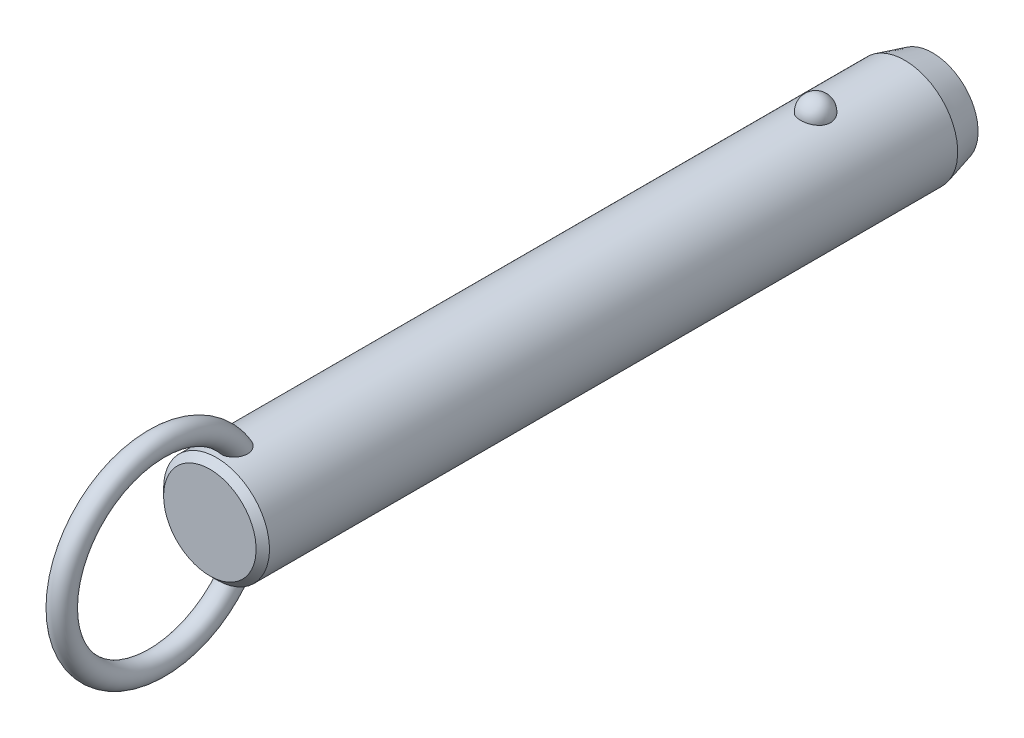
ISO-10303-21;
HEADER;
FILE_DESCRIPTION(('STEP AP214'),'2;1');
FILE_NAME('part.step','',(''),(''),'','','');
FILE_SCHEMA(('AUTOMOTIVE_DESIGN { 1 0 10303 214 1 1 1 1 }'));
ENDSEC;
DATA;
#1=APPLICATION_CONTEXT('core data for automotive mechanical design processes');
#2=APPLICATION_PROTOCOL_DEFINITION('international standard','automotive_design',2000,#1);
#3=PRODUCT_CONTEXT('',#1,'mechanical');
#4=PRODUCT('Part','Part','',(#3));
#5=PRODUCT_RELATED_PRODUCT_CATEGORY('part','',(#4));
#6=PRODUCT_DEFINITION_FORMATION('','',#4);
#7=PRODUCT_DEFINITION_CONTEXT('part definition',#1,'design');
#8=PRODUCT_DEFINITION('design','',#6,#7);
#9=PRODUCT_DEFINITION_SHAPE('','',#8);
#10=(LENGTH_UNIT() NAMED_UNIT(*) SI_UNIT(.MILLI.,.METRE.));
#11=(NAMED_UNIT(*) PLANE_ANGLE_UNIT() SI_UNIT($,.RADIAN.));
#12=(NAMED_UNIT(*) SI_UNIT($,.STERADIAN.) SOLID_ANGLE_UNIT());
#13=UNCERTAINTY_MEASURE_WITH_UNIT(LENGTH_MEASURE(1.E-05),#10,'distance_accuracy_value','');
#14=(GEOMETRIC_REPRESENTATION_CONTEXT(3) GLOBAL_UNCERTAINTY_ASSIGNED_CONTEXT((#13)) GLOBAL_UNIT_ASSIGNED_CONTEXT((#10,
#11,#12)) REPRESENTATION_CONTEXT('',''));
#15=CARTESIAN_POINT('',(0.,0.,0.));
#16=DIRECTION('',(0.,0.,1.));
#17=DIRECTION('',(1.,0.,0.));
#18=AXIS2_PLACEMENT_3D('',#15,#16,#17);
#19=CARTESIAN_POINT('',(0.,0.,96.5));
#20=DIRECTION('',(0.,0.,-1.));
#21=DIRECTION('',(-1.,0.,0.));
#22=AXIS2_PLACEMENT_3D('',#19,#20,#21);
#23=CYLINDRICAL_SURFACE('',#22,9.5);
#24=CARTESIAN_POINT('',(2.67259918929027,9.11631578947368,-2.70000000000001));
#25=CARTESIAN_POINT('',(2.6725968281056,9.11631786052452,-2.54909854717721));
#26=CARTESIAN_POINT('',(2.66030567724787,9.11994722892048,-2.39816735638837));
#27=CARTESIAN_POINT('',(2.6114347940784,9.13405924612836,-2.10058568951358));
#28=CARTESIAN_POINT('',(2.57484658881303,9.14454428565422,-1.95393672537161));
#29=CARTESIAN_POINT('',(2.47830875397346,9.17117631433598,-1.66916069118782));
#30=CARTESIAN_POINT('',(2.41836936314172,9.18732082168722,-1.53102991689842));
#31=CARTESIAN_POINT('',(2.27661331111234,9.22346780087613,-1.26705393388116));
#32=CARTESIAN_POINT('',(2.19479699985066,9.24347021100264,-1.14120852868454));
#33=CARTESIAN_POINT('',(2.01085282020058,9.28522401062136,-0.904632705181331));
#34=CARTESIAN_POINT('',(1.90862396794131,9.30698376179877,-0.793982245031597));
#35=CARTESIAN_POINT('',(1.6867437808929,9.34973971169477,-0.591607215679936));
#36=CARTESIAN_POINT('',(1.56709244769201,9.37073591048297,-0.499882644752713));
#37=CARTESIAN_POINT('',(1.31393976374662,9.40956370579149,-0.338167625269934));
#38=CARTESIAN_POINT('',(1.18048026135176,9.42740444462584,-0.268113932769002));
#39=CARTESIAN_POINT('',(0.903154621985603,9.45799906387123,-0.151390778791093));
#40=CARTESIAN_POINT('',(0.759289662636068,9.47075351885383,-0.104718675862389));
#41=CARTESIAN_POINT('',(0.468074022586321,9.48956256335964,-0.0367633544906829));
#42=CARTESIAN_POINT('',(0.320836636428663,9.49573643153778,-0.0150275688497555));
#43=CARTESIAN_POINT('',(0.0246714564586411,9.50112183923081,0.00396199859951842));
#44=CARTESIAN_POINT('',(-0.124256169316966,9.50033406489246,0.00121819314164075));
#45=CARTESIAN_POINT('',(-0.417264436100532,9.4919475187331,-0.0284441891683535));
#46=CARTESIAN_POINT('',(-0.56138413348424,9.48444885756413,-0.0550074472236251));
#47=CARTESIAN_POINT('',(-0.842986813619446,9.46357853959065,-0.131064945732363));
#48=CARTESIAN_POINT('',(-0.980469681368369,9.450206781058,-0.180559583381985));
#49=CARTESIAN_POINT('',(-1.24585005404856,9.41890822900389,-0.301476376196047));
#50=CARTESIAN_POINT('',(-1.37368611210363,9.40095498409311,-0.373026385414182));
#51=CARTESIAN_POINT('',(-1.61552738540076,9.36242964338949,-0.536025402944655));
#52=CARTESIAN_POINT('',(-1.72953116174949,9.34185727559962,-0.627476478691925));
#53=CARTESIAN_POINT('',(-1.9429225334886,9.29984568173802,-0.829844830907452));
#54=CARTESIAN_POINT('',(-2.04198021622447,9.27839736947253,-0.94110821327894));
#55=CARTESIAN_POINT('',(-2.22026460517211,9.23735994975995,-1.17883414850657));
#56=CARTESIAN_POINT('',(-2.29948985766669,9.21777097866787,-1.30529781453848));
#57=CARTESIAN_POINT('',(-2.43697287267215,9.18238994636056,-1.57158566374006));
#58=CARTESIAN_POINT('',(-2.49497068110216,9.16664569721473,-1.71155057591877));
#59=CARTESIAN_POINT('',(-2.5872073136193,9.14104303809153,-1.99961197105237));
#60=CARTESIAN_POINT('',(-2.62144683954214,9.13118445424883,-2.14770821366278));
#61=CARTESIAN_POINT('',(-2.66521466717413,9.11850622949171,-2.44715424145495));
#62=CARTESIAN_POINT('',(-2.67484831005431,9.11565658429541,-2.59848735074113));
#63=CARTESIAN_POINT('',(-2.66946735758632,9.11723375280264,-2.90067317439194));
#64=CARTESIAN_POINT('',(-2.65445345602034,9.12166036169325,-3.05152590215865));
#65=CARTESIAN_POINT('',(-2.60029711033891,9.13724422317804,-3.34766110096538));
#66=CARTESIAN_POINT('',(-2.56127978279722,9.14836656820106,-3.49296833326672));
#67=CARTESIAN_POINT('',(-2.46018844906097,9.17606676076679,-3.77477535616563));
#68=CARTESIAN_POINT('',(-2.39811349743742,9.1926448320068,-3.9112747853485));
#69=CARTESIAN_POINT('',(-2.25202303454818,9.22952198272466,-4.17244273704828));
#70=CARTESIAN_POINT('',(-2.16788714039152,9.24984129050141,-4.29704106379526));
#71=CARTESIAN_POINT('',(-1.9799408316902,9.29188255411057,-4.53013066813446));
#72=CARTESIAN_POINT('',(-1.87612963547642,9.31360456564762,-4.63862130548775));
#73=CARTESIAN_POINT('',(-1.65105429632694,9.35612959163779,-4.8369029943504));
#74=CARTESIAN_POINT('',(-1.52972405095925,9.37692871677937,-4.92661991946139));
#75=CARTESIAN_POINT('',(-1.27318250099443,9.41518970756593,-5.08429106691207));
#76=CARTESIAN_POINT('',(-1.13797219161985,9.432651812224,-5.15224684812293));
#77=CARTESIAN_POINT('',(-0.859280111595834,9.46208255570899,-5.26371827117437));
#78=CARTESIAN_POINT('',(-0.715925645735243,9.47411833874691,-5.30753421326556));
#79=CARTESIAN_POINT('',(-0.423550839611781,9.4916822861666,-5.37076321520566));
#80=CARTESIAN_POINT('',(-0.2745312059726,9.49721125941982,-5.39017930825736));
#81=CARTESIAN_POINT('',(0.0218446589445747,9.50110860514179,-5.40390587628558));
#82=CARTESIAN_POINT('',(0.16917707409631,9.49961381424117,-5.39869609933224));
#83=CARTESIAN_POINT('',(0.460808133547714,9.48993906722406,-5.36441955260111));
#84=CARTESIAN_POINT('',(0.605106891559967,9.48175936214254,-5.33535367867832));
#85=CARTESIAN_POINT('',(0.886027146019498,9.4596376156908,-5.25435587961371));
#86=CARTESIAN_POINT('',(1.02267710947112,9.44571881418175,-5.20251612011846));
#87=CARTESIAN_POINT('',(1.28523827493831,9.41358993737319,-5.07741549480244));
#88=CARTESIAN_POINT('',(1.41114877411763,9.39537958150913,-5.00415322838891));
#89=CARTESIAN_POINT('',(1.65085227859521,9.3562644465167,-4.83684599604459));
#90=CARTESIAN_POINT('',(1.76442346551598,9.33532178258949,-4.74249218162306));
#91=CARTESIAN_POINT('',(1.97425672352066,9.29321198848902,-4.53620389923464));
#92=CARTESIAN_POINT('',(2.07051582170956,9.27204482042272,-4.42426641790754));
#93=CARTESIAN_POINT('',(2.24490086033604,9.23139221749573,-4.18363183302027));
#94=CARTESIAN_POINT('',(2.32267019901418,9.21194380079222,-4.05466990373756));
#95=CARTESIAN_POINT('',(2.45584092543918,9.1773419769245,-3.78517836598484));
#96=CARTESIAN_POINT('',(2.5112497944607,9.16218713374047,-3.64465264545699));
#97=CARTESIAN_POINT('',(2.59380876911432,9.13913522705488,-3.37104301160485));
#98=CARTESIAN_POINT('',(2.62330266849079,9.13064624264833,-3.23871053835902));
#99=CARTESIAN_POINT('',(2.66269870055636,9.11923566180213,-2.97092664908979));
#100=CARTESIAN_POINT('',(2.67260130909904,9.11631393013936,-2.83547530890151));
#101=CARTESIAN_POINT('',(2.67259918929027,9.11631578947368,-2.70000000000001));
#102=B_SPLINE_CURVE_WITH_KNOTS('',3,(#24,#25,#26,#27,#28,#29,#30,#31,#32,#33,#34,#35,#36,#37,
#38,#39,#40,#41,#42,#43,#44,#45,#46,#47,#48,#49,#50,#51,#52,#53,#54,#55,#56,#57,#58,#59,#60,#61,
#62,#63,#64,#65,#66,#67,#68,#69,#70,#71,#72,#73,#74,#75,#76,#77,#78,#79,#80,#81,#82,#83,#84,#85,
#86,#87,#88,#89,#90,#91,#92,#93,#94,#95,#96,#97,#98,#99,#100,#101),.UNSPECIFIED.,.T.,.F.,(4,2,2,
2,2,2,2,2,2,2,2,2,2,2,2,2,2,2,2,2,2,2,2,2,2,2,2,2,2,2,2,2,2,2,2,2,2,2,4),(0.,0.452217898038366,
0.904593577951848,1.35677112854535,1.80894144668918,2.26340676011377,2.71787203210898,
3.17099820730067,3.62407318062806,4.0687883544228,4.51345969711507,4.95160616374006,
5.38976021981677,5.83050358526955,6.27129275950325,6.72071308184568,7.17016633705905,
7.62495278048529,8.07972578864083,8.53254856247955,8.98535859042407,9.43582813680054,
9.88631615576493,10.3393155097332,10.7923328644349,11.2471065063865,11.7018475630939,
12.150795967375,12.599688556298,13.0398725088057,13.4800399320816,13.9184421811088,
14.3568730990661,14.802202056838,15.2476074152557,15.7010097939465,16.1542603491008,
16.5602594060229,16.966248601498),.UNSPECIFIED.);
#103=CARTESIAN_POINT('',(2.67259918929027,9.11631578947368,-2.70000000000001));
#104=VERTEX_POINT('',#103);
#105=EDGE_CURVE('E41',#104,#104,#102,.T.);
#106=ORIENTED_EDGE('',*,*,#105,.T.);
#107=EDGE_LOOP('',(#106));
#108=FACE_BOUND('',#107,.T.);
#109=CARTESIAN_POINT('',(0.,0.,104.82));
#110=DIRECTION('',(0.,0.,1.));
#111=DIRECTION('',(1.,0.,0.));
#112=AXIS2_PLACEMENT_3D('',#109,#110,#111);
#113=CIRCLE('',#112,9.5);
#114=CARTESIAN_POINT('',(-9.50000000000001,0.,104.82));
#115=VERTEX_POINT('',#114);
#116=EDGE_CURVE('E10',#115,#115,#113,.F.);
#117=ORIENTED_EDGE('',*,*,#116,.T.);
#118=EDGE_LOOP('',(#117));
#119=FACE_BOUND('',#118,.T.);
#120=CARTESIAN_POINT('',(-0.697062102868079,-9.47439269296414,99.1678088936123));
#121=CARTESIAN_POINT('',(-0.799579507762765,-9.46685146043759,99.2074823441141));
#122=CARTESIAN_POINT('',(-0.898575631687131,-9.45788043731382,99.2559309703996));
#123=CARTESIAN_POINT('',(-1.08670047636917,-9.43811593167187,99.3688685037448));
#124=CARTESIAN_POINT('',(-1.17583204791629,-9.42732297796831,99.4333527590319));
#125=CARTESIAN_POINT('',(-1.34179806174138,-9.40513672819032,99.5762099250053));
#126=CARTESIAN_POINT('',(-1.41865133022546,-9.39374438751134,99.654561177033));
#127=CARTESIAN_POINT('',(-1.5586004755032,-9.37154196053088,99.8227524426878));
#128=CARTESIAN_POINT('',(-1.62169476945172,-9.3607319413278,99.9125937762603));
#129=CARTESIAN_POINT('',(-1.73527695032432,-9.34035749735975,100.104500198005));
#130=CARTESIAN_POINT('',(-1.7852226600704,-9.33085270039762,100.206891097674));
#131=CARTESIAN_POINT('',(-1.86924997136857,-9.3143834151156,100.418148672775));
#132=CARTESIAN_POINT('',(-1.90332570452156,-9.30741986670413,100.527017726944));
#133=CARTESIAN_POINT('',(-1.95893603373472,-9.29588482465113,100.760473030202));
#134=CARTESIAN_POINT('',(-1.97872420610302,-9.29165182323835,100.885489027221));
#135=CARTESIAN_POINT('',(-2.00062129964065,-9.28695978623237,101.137080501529));
#136=CARTESIAN_POINT('',(-2.00272284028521,-9.28650232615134,101.263656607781));
#137=CARTESIAN_POINT('',(-1.98958876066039,-9.28932750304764,101.536815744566));
#138=CARTESIAN_POINT('',(-1.97143366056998,-9.2932400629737,101.683251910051));
#139=CARTESIAN_POINT('',(-1.91479925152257,-9.30507151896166,101.972062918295));
#140=CARTESIAN_POINT('',(-1.87629122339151,-9.31299607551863,102.114431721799));
#141=CARTESIAN_POINT('',(-1.77225683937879,-9.33340232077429,102.415172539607));
#142=CARTESIAN_POINT('',(-1.70334898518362,-9.34641636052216,102.572369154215));
#143=CARTESIAN_POINT('',(-1.58111062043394,-9.36759153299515,102.797517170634));
#144=CARTESIAN_POINT('',(-1.53721459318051,-9.37492619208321,102.870796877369));
#145=CARTESIAN_POINT('',(-1.44302631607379,-9.38988566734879,103.01307405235));
#146=CARTESIAN_POINT('',(-1.39273721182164,-9.39751033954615,103.082073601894));
#147=CARTESIAN_POINT('',(-1.26775962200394,-9.41530678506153,103.236983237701));
#148=CARTESIAN_POINT('',(-1.19052326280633,-9.42548108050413,103.320871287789));
#149=CARTESIAN_POINT('',(-1.02420241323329,-9.44499825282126,103.476008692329));
#150=CARTESIAN_POINT('',(-0.935139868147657,-9.45434261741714,103.547280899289));
#151=CARTESIAN_POINT('',(-0.766610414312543,-9.46930670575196,103.658695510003));
#152=CARTESIAN_POINT('',(-0.689439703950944,-9.47529223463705,103.702235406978));
#153=CARTESIAN_POINT('',(-0.528942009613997,-9.48560294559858,103.77631336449));
#154=CARTESIAN_POINT('',(-0.445620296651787,-9.48992953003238,103.806862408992));
#155=CARTESIAN_POINT('',(-0.273901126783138,-9.49644161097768,103.852579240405));
#156=CARTESIAN_POINT('',(-0.185465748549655,-9.49860811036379,103.86761059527));
#157=CARTESIAN_POINT('',(-0.00734541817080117,-9.5004135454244,103.880149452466));
#158=CARTESIAN_POINT('',(0.0823387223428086,-9.50005405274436,103.877667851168));
#159=CARTESIAN_POINT('',(0.247679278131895,-9.49708301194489,103.856995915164));
#160=CARTESIAN_POINT('',(0.323620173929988,-9.49477609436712,103.840930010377));
#161=CARTESIAN_POINT('',(0.471981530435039,-9.48855917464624,103.797172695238));
#162=CARTESIAN_POINT('',(0.544400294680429,-9.48464840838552,103.769475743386));
#163=CARTESIAN_POINT('',(0.70894789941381,-9.47398336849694,103.69280266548));
#164=CARTESIAN_POINT('',(0.799149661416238,-9.46671310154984,103.639774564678));
#165=CARTESIAN_POINT('',(0.969783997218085,-9.45076225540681,103.519973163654));
#166=CARTESIAN_POINT('',(1.05019415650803,-9.44207854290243,103.453169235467));
#167=CARTESIAN_POINT('',(1.23092343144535,-9.42051459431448,103.280759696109));
#168=CARTESIAN_POINT('',(1.3265249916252,-9.40733378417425,103.17026193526));
#169=CARTESIAN_POINT('',(1.49893121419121,-9.38140745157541,102.935561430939));
#170=CARTESIAN_POINT('',(1.57571616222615,-9.36866239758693,102.811344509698));
#171=CARTESIAN_POINT('',(1.71285426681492,-9.34457644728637,102.549389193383));
#172=CARTESIAN_POINT('',(1.77266365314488,-9.33328726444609,102.41136233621));
#173=CARTESIAN_POINT('',(1.87239208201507,-9.31379209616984,102.128051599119));
#174=CARTESIAN_POINT('',(1.9123015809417,-9.3055875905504,101.982764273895));
#175=CARTESIAN_POINT('',(1.97604189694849,-9.29228394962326,101.662028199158));
#176=CARTESIAN_POINT('',(1.99587438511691,-9.28797202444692,101.485724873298));
#177=CARTESIAN_POINT('',(2.0029570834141,-9.28645519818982,101.132414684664));
#178=CARTESIAN_POINT('',(1.99025930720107,-9.28923895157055,100.955409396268));
#179=CARTESIAN_POINT('',(1.93735479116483,-9.30038134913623,100.656338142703));
#180=CARTESIAN_POINT('',(1.90576827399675,-9.30697680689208,100.532667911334));
#181=CARTESIAN_POINT('',(1.82287484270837,-9.32356855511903,100.292329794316));
#182=CARTESIAN_POINT('',(1.77158213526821,-9.33356239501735,100.175656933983));
#183=CARTESIAN_POINT('',(1.64885744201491,-9.35602275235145,99.9527061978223));
#184=CARTESIAN_POINT('',(1.57730995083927,-9.36850332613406,99.8464927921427));
#185=CARTESIAN_POINT('',(1.4154326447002,-9.39431873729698,99.6495530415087));
#186=CARTESIAN_POINT('',(1.32510883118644,-9.40765330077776,99.5588217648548));
#187=CARTESIAN_POINT('',(1.13846223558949,-9.43195720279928,99.4050334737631));
#188=CARTESIAN_POINT('',(1.04369890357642,-9.44302894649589,99.3400947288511));
#189=CARTESIAN_POINT('',(0.843965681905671,-9.46296805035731,99.2280388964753));
#190=CARTESIAN_POINT('',(0.739000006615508,-9.47183631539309,99.1809144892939));
#191=CARTESIAN_POINT('',(0.528175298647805,-9.48586140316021,99.1081173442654));
#192=CARTESIAN_POINT('',(0.422686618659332,-9.49119633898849,99.0814024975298));
#193=CARTESIAN_POINT('',(0.208590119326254,-9.49831365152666,99.0460137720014));
#194=CARTESIAN_POINT('',(0.0999817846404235,-9.500095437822,99.0373428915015));
#195=CARTESIAN_POINT('',(-0.126104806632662,-9.49988861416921,99.0383501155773));
#196=CARTESIAN_POINT('',(-0.24357872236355,-9.49757821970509,99.0495942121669));
#197=CARTESIAN_POINT('',(-0.474390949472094,-9.48885165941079,99.093167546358));
#198=CARTESIAN_POINT('',(-0.587729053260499,-9.48243528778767,99.1254978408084));
#199=CARTESIAN_POINT('',(-0.697062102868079,-9.47439269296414,99.1678088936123));
#200=B_SPLINE_CURVE_WITH_KNOTS('',3,(#120,#121,#122,#123,#124,#125,#126,#127,#128,#129,#130,
#131,#132,#133,#134,#135,#136,#137,#138,#139,#140,#141,#142,#143,#144,#145,#146,#147,#148,#149,
#150,#151,#152,#153,#154,#155,#156,#157,#158,#159,#160,#161,#162,#163,#164,#165,#166,#167,#168,
#169,#170,#171,#172,#173,#174,#175,#176,#177,#178,#179,#180,#181,#182,#183,#184,#185,#186,#187,
#188,#189,#190,#191,#192,#193,#194,#195,#196,#197,#198,#199),.UNSPECIFIED.,.T.,.F.,(4,2,2,2,2,2,
2,2,2,2,2,2,2,2,2,2,2,2,2,2,2,2,2,2,2,2,2,2,2,2,2,2,2,2,2,2,2,2,2,4),(0.,0.330119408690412,
0.660143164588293,0.989655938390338,1.31920659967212,1.66074728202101,2.00241415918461,
2.38088696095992,2.7595176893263,3.20065679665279,3.6424200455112,4.15620996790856,
4.41314162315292,4.66994734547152,5.01228664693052,5.35399933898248,5.61943037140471,
5.88463652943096,6.15215502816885,6.41950709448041,6.65144391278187,6.88349136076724,
7.19641200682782,7.51003602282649,7.94779711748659,8.38601491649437,8.83699707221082,
9.28819530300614,9.81778662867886,10.3465317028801,10.7284172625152,11.110028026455,
11.4938603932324,11.8775702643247,12.2220189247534,12.5663259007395,12.8915939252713,
13.2169159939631,13.5689650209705,13.9210316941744),.UNSPECIFIED.);
#201=CARTESIAN_POINT('',(-0.697062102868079,-9.47439269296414,99.1678088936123));
#202=VERTEX_POINT('',#201);
#203=EDGE_CURVE('E60',#202,#202,#200,.T.);
#204=ORIENTED_EDGE('',*,*,#203,.T.);
#205=EDGE_LOOP('',(#204));
#206=FACE_BOUND('',#205,.T.);
#207=CARTESIAN_POINT('',(-0.697062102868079,9.47439269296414,99.1678088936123));
#208=CARTESIAN_POINT('',(-0.59779262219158,9.48169483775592,99.1293956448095));
#209=CARTESIAN_POINT('',(-0.495106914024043,9.48766580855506,99.0991682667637));
#210=CARTESIAN_POINT('',(-0.285876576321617,9.49627648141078,99.0560327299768));
#211=CARTESIAN_POINT('',(-0.179324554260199,9.49890941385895,99.0431597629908));
#212=CARTESIAN_POINT('',(0.0344157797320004,9.50053798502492,99.0351666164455));
#213=CARTESIAN_POINT('',(0.141603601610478,9.49953613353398,99.0400341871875));
#214=CARTESIAN_POINT('',(0.353563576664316,9.49401038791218,99.0673654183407));
#215=CARTESIAN_POINT('',(0.458336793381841,9.48948807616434,99.08982117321));
#216=CARTESIAN_POINT('',(0.66249373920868,9.4774236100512,99.1516719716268));
#217=CARTESIAN_POINT('',(0.761881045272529,9.46988348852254,99.1910556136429));
#218=CARTESIAN_POINT('',(0.952608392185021,9.45260382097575,99.2856342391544));
#219=CARTESIAN_POINT('',(1.04394806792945,9.44286417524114,99.3408299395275));
#220=CARTESIAN_POINT('',(1.21712767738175,9.42211760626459,99.4660662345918));
#221=CARTESIAN_POINT('',(1.29885671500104,9.41109835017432,99.5362579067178));
#222=CARTESIAN_POINT('',(1.44978975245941,9.38903310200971,99.688980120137));
#223=CARTESIAN_POINT('',(1.51899278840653,9.37798710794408,99.7715116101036));
#224=CARTESIAN_POINT('',(1.64602857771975,9.35654375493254,99.9497763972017));
#225=CARTESIAN_POINT('',(1.70333052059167,9.34618688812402,100.045891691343));
#226=CARTESIAN_POINT('',(1.80259341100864,9.32755128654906,100.245897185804));
#227=CARTESIAN_POINT('',(1.84454942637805,9.31927322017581,100.349789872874));
#228=CARTESIAN_POINT('',(1.91637039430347,9.30478365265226,100.572213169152));
#229=CARTESIAN_POINT('',(1.944805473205,9.29882552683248,100.691219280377));
#230=CARTESIAN_POINT('',(1.98449865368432,9.29043398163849,100.932143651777));
#231=CARTESIAN_POINT('',(1.99574908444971,9.28800213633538,101.054063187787));
#232=CARTESIAN_POINT('',(2.00275141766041,9.28649645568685,101.316932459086));
#233=CARTESIAN_POINT('',(1.99588238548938,9.28799035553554,101.457952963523));
#234=CARTESIAN_POINT('',(1.96270559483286,9.29505517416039,101.737621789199));
#235=CARTESIAN_POINT('',(1.93637872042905,9.30063010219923,101.876267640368));
#236=CARTESIAN_POINT('',(1.85949176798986,9.31633564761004,102.172561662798));
#237=CARTESIAN_POINT('',(1.80549792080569,9.3270926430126,102.329290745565));
#238=CARTESIAN_POINT('',(1.67376869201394,9.3516306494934,102.632284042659));
#239=CARTESIAN_POINT('',(1.59603181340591,9.36541185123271,102.778547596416));
#240=CARTESIAN_POINT('',(1.4360277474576,9.39110706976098,103.025813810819));
#241=CARTESIAN_POINT('',(1.35831795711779,9.40278656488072,103.129791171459));
#242=CARTESIAN_POINT('',(1.18774483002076,9.42585025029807,103.324534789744));
#243=CARTESIAN_POINT('',(1.09490932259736,9.43723493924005,103.415324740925));
#244=CARTESIAN_POINT('',(0.921110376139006,9.45552616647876,103.55620334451));
#245=CARTESIAN_POINT('',(0.843738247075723,9.46281058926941,103.610656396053));
#246=CARTESIAN_POINT('',(0.681245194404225,9.47589120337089,103.706711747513));
#247=CARTESIAN_POINT('',(0.596135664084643,9.48168953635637,103.748332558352));
#248=CARTESIAN_POINT('',(0.433779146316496,9.49038144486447,103.810089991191));
#249=CARTESIAN_POINT('',(0.357459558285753,9.49359170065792,103.83260136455));
#250=CARTESIAN_POINT('',(0.202074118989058,9.49816761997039,103.864574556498));
#251=CARTESIAN_POINT('',(0.123010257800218,9.49953459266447,103.874045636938));
#252=CARTESIAN_POINT('',(-0.0357372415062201,9.50026497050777,103.879114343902));
#253=CARTESIAN_POINT('',(-0.115421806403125,9.49962433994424,103.874684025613));
#254=CARTESIAN_POINT('',(-0.272823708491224,9.49640854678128,103.852296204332));
#255=CARTESIAN_POINT('',(-0.350540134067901,9.4938325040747,103.834332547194));
#256=CARTESIAN_POINT('',(-0.500580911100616,9.4870946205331,103.786802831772));
#257=CARTESIAN_POINT('',(-0.57297929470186,9.48296359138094,103.757461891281));
#258=CARTESIAN_POINT('',(-0.712864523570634,9.47347609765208,103.689008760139));
#259=CARTESIAN_POINT('',(-0.780349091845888,9.46811906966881,103.649892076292));
#260=CARTESIAN_POINT('',(-0.946309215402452,9.45329720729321,103.539432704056));
#261=CARTESIAN_POINT('',(-1.04090230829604,9.44321512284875,103.462329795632));
#262=CARTESIAN_POINT('',(-1.21661929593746,9.42219227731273,103.29409718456));
#263=CARTESIAN_POINT('',(-1.29770519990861,9.41124921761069,103.202929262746));
#264=CARTESIAN_POINT('',(-1.47319646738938,9.38563439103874,102.976162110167));
#265=CARTESIAN_POINT('',(-1.5620887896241,9.37102009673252,102.836289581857));
#266=CARTESIAN_POINT('',(-1.71623987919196,9.34401559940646,102.543950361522));
#267=CARTESIAN_POINT('',(-1.78147866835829,9.33162728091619,102.391473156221));
#268=CARTESIAN_POINT('',(-1.88853837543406,9.31055541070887,102.075647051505));
#269=CARTESIAN_POINT('',(-1.92998995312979,9.30193076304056,101.912168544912));
#270=CARTESIAN_POINT('',(-1.98590726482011,9.29015757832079,101.580526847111));
#271=CARTESIAN_POINT('',(-2.0004070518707,9.2870021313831,101.412369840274));
#272=CARTESIAN_POINT('',(-1.99964701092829,9.28716218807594,101.105080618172));
#273=CARTESIAN_POINT('',(-1.98908145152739,9.28945704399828,100.965936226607));
#274=CARTESIAN_POINT('',(-1.94566294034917,9.29865169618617,100.691153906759));
#275=CARTESIAN_POINT('',(-1.91282062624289,9.30554929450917,100.555514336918));
#276=CARTESIAN_POINT('',(-1.84582133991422,9.31898248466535,100.357802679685));
#277=CARTESIAN_POINT('',(-1.82038084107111,9.32400364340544,100.292583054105));
#278=CARTESIAN_POINT('',(-1.7635051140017,9.33492884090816,100.164903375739));
#279=CARTESIAN_POINT('',(-1.73207305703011,9.34083241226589,100.102441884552));
#280=CARTESIAN_POINT('',(-1.6632424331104,9.353333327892,99.9809407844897));
#281=CARTESIAN_POINT('',(-1.62584239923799,9.35993084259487,99.9219020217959));
#282=CARTESIAN_POINT('',(-1.54527678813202,9.37356864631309,99.8079875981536));
#283=CARTESIAN_POINT('',(-1.50211241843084,9.38060884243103,99.7531110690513));
#284=CARTESIAN_POINT('',(-1.37681147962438,9.40004442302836,99.6099619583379));
#285=CARTESIAN_POINT('',(-1.28916358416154,9.41261047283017,99.5264295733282));
#286=CARTESIAN_POINT('',(-1.09996826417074,9.43658180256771,99.3772360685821));
#287=CARTESIAN_POINT('',(-0.998461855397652,9.44799034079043,99.3115238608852));
#288=CARTESIAN_POINT('',(-0.860188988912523,9.46103017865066,99.2394367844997));
#289=CARTESIAN_POINT('',(-0.828141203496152,9.46389141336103,99.2238511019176));
#290=CARTESIAN_POINT('',(-0.763210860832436,9.46934915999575,99.1944734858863));
#291=CARTESIAN_POINT('',(-0.730328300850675,9.47194567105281,99.1806815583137));
#292=CARTESIAN_POINT('',(-0.697062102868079,9.47439269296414,99.1678088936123));
#293=B_SPLINE_CURVE_WITH_KNOTS('',3,(#207,#208,#209,#210,#211,#212,#213,#214,#215,#216,#217,
#218,#219,#220,#221,#222,#223,#224,#225,#226,#227,#228,#229,#230,#231,#232,#233,#234,#235,#236,
#237,#238,#239,#240,#241,#242,#243,#244,#245,#246,#247,#248,#249,#250,#251,#252,#253,#254,#255,
#256,#257,#258,#259,#260,#261,#262,#263,#264,#265,#266,#267,#268,#269,#270,#271,#272,#273,#274,
#275,#276,#277,#278,#279,#280,#281,#282,#283,#284,#285,#286,#287,#288,#289,#290,#291,#292),
.UNSPECIFIED.,.T.,.F.,(4,2,2,2,2,2,2,2,2,2,2,2,2,2,2,2,2,2,2,2,2,2,2,2,2,2,2,2,2,2,2,2,2,2,2,2,
2,2,2,2,2,2,4),(0.,0.319942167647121,0.640532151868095,0.960900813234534,1.28112555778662,
1.60113495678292,1.92115886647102,2.24457323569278,2.56801248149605,2.90371927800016,
3.23953387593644,3.60560313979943,3.97183576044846,4.39383693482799,4.81625324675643,
5.31257045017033,5.80891895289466,6.19868344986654,6.58773876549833,6.87145417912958,
7.15475838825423,7.3926375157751,7.63034760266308,7.86853584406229,8.10683246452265,
8.3406366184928,8.57454843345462,8.93983939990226,9.30614105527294,9.80266668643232,
10.2996107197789,10.8040753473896,11.3079021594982,11.7249776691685,12.1418541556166,
12.3521485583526,12.562331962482,12.7725671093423,12.9827582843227,13.345827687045,
13.7078449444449,13.8150604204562,13.9222762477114),.UNSPECIFIED.);
#294=CARTESIAN_POINT('',(-0.697062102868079,9.47439269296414,99.1678088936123));
#295=VERTEX_POINT('',#294);
#296=EDGE_CURVE('E68',#295,#295,#293,.T.);
#297=ORIENTED_EDGE('',*,*,#296,.T.);
#298=EDGE_LOOP('',(#297));
#299=FACE_BOUND('',#298,.T.);
#300=CARTESIAN_POINT('',(0.,0.,-18.6999999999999));
#301=DIRECTION('',(0.,0.,-1.));
#302=DIRECTION('',(-1.,0.,0.));
#303=AXIS2_PLACEMENT_3D('',#300,#301,#302);
#304=CIRCLE('',#303,9.5);
#305=CARTESIAN_POINT('',(-9.5,0.,-18.6999999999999));
#306=VERTEX_POINT('',#305);
#307=EDGE_CURVE('E57',#306,#306,#304,.F.);
#308=ORIENTED_EDGE('',*,*,#307,.T.);
#309=EDGE_LOOP('',(#308));
#310=FACE_BOUND('',#309,.T.);
#311=ADVANCED_FACE('F37',(#108,#119,#206,#299,#310),#23,.T.);
#312=CARTESIAN_POINT('',(0.,0.,-23.7));
#313=DIRECTION('',(0.,0.,-1.));
#314=DIRECTION('',(-1.,0.,0.));
#315=AXIS2_PLACEMENT_3D('',#312,#313,#314);
#316=PLANE('',#315);
#317=CARTESIAN_POINT('',(0.,0.,-23.7));
#318=DIRECTION('',(0.,0.,-1.));
#319=DIRECTION('',(-1.,0.,0.));
#320=AXIS2_PLACEMENT_3D('',#317,#318,#319);
#321=CIRCLE('',#320,8.16025403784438);
#322=CARTESIAN_POINT('',(-8.16025403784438,0.,-23.7));
#323=VERTEX_POINT('',#322);
#324=EDGE_CURVE('E67',#323,#323,#321,.T.);
#325=ORIENTED_EDGE('',*,*,#324,.T.);
#326=EDGE_LOOP('',(#325));
#327=FACE_BOUND('',#326,.T.);
#328=ADVANCED_FACE('F86',(#327),#316,.T.);
#329=CARTESIAN_POINT('',(0.,0.,-23.7));
#330=DIRECTION('',(0.,0.,1.));
#331=DIRECTION('',(1.,0.,0.));
#332=AXIS2_PLACEMENT_3D('',#329,#330,#331);
#333=CONICAL_SURFACE('',#332,8.16025403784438,0.261799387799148);
#334=ORIENTED_EDGE('',*,*,#307,.F.);
#335=EDGE_LOOP('',(#334));
#336=FACE_BOUND('',#335,.T.);
#337=ORIENTED_EDGE('',*,*,#324,.F.);
#338=EDGE_LOOP('',(#337));
#339=FACE_BOUND('',#338,.T.);
#340=ADVANCED_FACE('F84',(#336,#339),#333,.T.);
#341=CARTESIAN_POINT('',(0.,0.,106.02));
#342=DIRECTION('',(0.,0.,1.));
#343=DIRECTION('',(1.,0.,0.));
#344=AXIS2_PLACEMENT_3D('',#341,#342,#343);
#345=PLANE('',#344);
#346=CARTESIAN_POINT('',(0.,0.,106.02));
#347=DIRECTION('',(0.,0.,1.));
#348=DIRECTION('',(1.,0.,0.));
#349=AXIS2_PLACEMENT_3D('',#346,#347,#348);
#350=CIRCLE('',#349,8.29999999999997);
#351=CARTESIAN_POINT('',(-8.29999999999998,0.,106.02));
#352=VERTEX_POINT('',#351);
#353=EDGE_CURVE('E50',#352,#352,#350,.T.);
#354=ORIENTED_EDGE('',*,*,#353,.T.);
#355=EDGE_LOOP('',(#354));
#356=FACE_BOUND('',#355,.T.);
#357=ADVANCED_FACE('F78',(#356),#345,.T.);
#358=CARTESIAN_POINT('',(0.,0.,115.55));
#359=DIRECTION('',(1.,0.,0.));
#360=DIRECTION('',(0.,0.,-1.));
#361=AXIS2_PLACEMENT_3D('',#358,#359,#360);
#362=TOROIDAL_SURFACE('',#361,17.05,2.);
#363=ORIENTED_EDGE('',*,*,#296,.F.);
#364=EDGE_LOOP('',(#363));
#365=FACE_BOUND('',#364,.T.);
#366=ORIENTED_EDGE('',*,*,#203,.F.);
#367=EDGE_LOOP('',(#366));
#368=FACE_BOUND('',#367,.T.);
#369=ADVANCED_FACE('F74',(#365,#368),#362,.T.);
#370=CARTESIAN_POINT('',(0.,0.,106.02));
#371=DIRECTION('',(0.,0.,-1.));
#372=DIRECTION('',(-1.,0.,0.));
#373=AXIS2_PLACEMENT_3D('',#370,#371,#372);
#374=CONICAL_SURFACE('',#373,8.29999999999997,0.78539816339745);
#375=CARTESIAN_POINT('',(-9.50000000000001,0.,104.82));
#376=CARTESIAN_POINT('',(-9.48750000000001,0.,104.8325));
#377=CARTESIAN_POINT('',(-9.47500000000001,0.,104.845));
#378=CARTESIAN_POINT('',(-9.45,0.,104.87));
#379=CARTESIAN_POINT('',(-9.4375,0.,104.8825));
#380=CARTESIAN_POINT('',(-9.4125,0.,104.9075));
#381=CARTESIAN_POINT('',(-9.4,0.,104.92));
#382=CARTESIAN_POINT('',(-9.37500000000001,0.,104.945));
#383=CARTESIAN_POINT('',(-9.3625,0.,104.9575));
#384=CARTESIAN_POINT('',(-9.3375,0.,104.9825));
#385=CARTESIAN_POINT('',(-9.325,0.,104.995));
#386=CARTESIAN_POINT('',(-9.3,0.,105.02));
#387=CARTESIAN_POINT('',(-9.2875,0.,105.0325));
#388=CARTESIAN_POINT('',(-9.2625,0.,105.0575));
#389=CARTESIAN_POINT('',(-9.25,0.,105.07));
#390=CARTESIAN_POINT('',(-9.225,0.,105.095));
#391=CARTESIAN_POINT('',(-9.2125,0.,105.1075));
#392=CARTESIAN_POINT('',(-9.1875,0.,105.1325));
#393=CARTESIAN_POINT('',(-9.175,0.,105.145));
#394=CARTESIAN_POINT('',(-9.15,0.,105.17));
#395=CARTESIAN_POINT('',(-9.1375,0.,105.1825));
#396=CARTESIAN_POINT('',(-9.1125,0.,105.2075));
#397=CARTESIAN_POINT('',(-9.1,0.,105.22));
#398=CARTESIAN_POINT('',(-9.075,0.,105.245));
#399=CARTESIAN_POINT('',(-9.0625,0.,105.2575));
#400=CARTESIAN_POINT('',(-9.0375,0.,105.2825));
#401=CARTESIAN_POINT('',(-9.025,0.,105.295));
#402=CARTESIAN_POINT('',(-9.,0.,105.32));
#403=CARTESIAN_POINT('',(-8.98749999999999,0.,105.3325));
#404=CARTESIAN_POINT('',(-8.9625,0.,105.3575));
#405=CARTESIAN_POINT('',(-8.94999999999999,0.,105.37));
#406=CARTESIAN_POINT('',(-8.925,0.,105.395));
#407=CARTESIAN_POINT('',(-8.91249999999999,0.,105.4075));
#408=CARTESIAN_POINT('',(-8.88749999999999,0.,105.4325));
#409=CARTESIAN_POINT('',(-8.87499999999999,0.,105.445));
#410=CARTESIAN_POINT('',(-8.84999999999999,0.,105.47));
#411=CARTESIAN_POINT('',(-8.83749999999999,0.,105.4825));
#412=CARTESIAN_POINT('',(-8.81249999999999,0.,105.5075));
#413=CARTESIAN_POINT('',(-8.79999999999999,0.,105.52));
#414=CARTESIAN_POINT('',(-8.77499999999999,0.,105.545));
#415=CARTESIAN_POINT('',(-8.76249999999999,0.,105.5575));
#416=CARTESIAN_POINT('',(-8.73749999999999,0.,105.5825));
#417=CARTESIAN_POINT('',(-8.72499999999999,0.,105.595));
#418=CARTESIAN_POINT('',(-8.69999999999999,0.,105.62));
#419=CARTESIAN_POINT('',(-8.68749999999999,0.,105.6325));
#420=CARTESIAN_POINT('',(-8.66249999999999,0.,105.6575));
#421=CARTESIAN_POINT('',(-8.64999999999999,0.,105.67));
#422=CARTESIAN_POINT('',(-8.62499999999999,0.,105.695));
#423=CARTESIAN_POINT('',(-8.61249999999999,0.,105.7075));
#424=CARTESIAN_POINT('',(-8.58749999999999,0.,105.7325));
#425=CARTESIAN_POINT('',(-8.57499999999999,0.,105.745));
#426=CARTESIAN_POINT('',(-8.54999999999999,0.,105.77));
#427=CARTESIAN_POINT('',(-8.53749999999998,0.,105.7825));
#428=CARTESIAN_POINT('',(-8.51249999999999,0.,105.8075));
#429=CARTESIAN_POINT('',(-8.49999999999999,0.,105.82));
#430=CARTESIAN_POINT('',(-8.47499999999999,0.,105.845));
#431=CARTESIAN_POINT('',(-8.46249999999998,0.,105.8575));
#432=CARTESIAN_POINT('',(-8.43749999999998,0.,105.8825));
#433=CARTESIAN_POINT('',(-8.42499999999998,0.,105.895));
#434=CARTESIAN_POINT('',(-8.39999999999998,0.,105.92));
#435=CARTESIAN_POINT('',(-8.38749999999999,0.,105.9325));
#436=CARTESIAN_POINT('',(-8.36249999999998,0.,105.9575));
#437=CARTESIAN_POINT('',(-8.34999999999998,0.,105.97));
#438=CARTESIAN_POINT('',(-8.32499999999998,0.,105.995));
#439=CARTESIAN_POINT('',(-8.31249999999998,0.,106.0075));
#440=CARTESIAN_POINT('',(-8.29999999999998,0.,106.02));
#441=B_SPLINE_CURVE_WITH_KNOTS('',3,(#375,#376,#377,#378,#379,#380,#381,#382,#383,#384,#385,
#386,#387,#388,#389,#390,#391,#392,#393,#394,#395,#396,#397,#398,#399,#400,#401,#402,#403,#404,
#405,#406,#407,#408,#409,#410,#411,#412,#413,#414,#415,#416,#417,#418,#419,#420,#421,#422,#423,
#424,#425,#426,#427,#428,#429,#430,#431,#432,#433,#434,#435,#436,#437,#438,#439,#440),
.UNSPECIFIED.,.F.,.F.,(4,2,2,2,2,2,2,2,2,2,2,2,2,2,2,2,2,2,2,2,2,2,2,2,2,2,2,2,2,2,2,2,4),(0.,
0.0530330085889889,0.106066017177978,0.159099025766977,0.212132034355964,0.265165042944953,
0.318198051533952,0.371231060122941,0.42426406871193,0.477297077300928,0.530330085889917,
0.583363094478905,0.636396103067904,0.689429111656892,0.742462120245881,0.79549512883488,
0.848528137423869,0.901561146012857,0.954594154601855,1.00762716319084,1.06066017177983,
1.11369318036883,1.16672618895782,1.21975919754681,1.27279220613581,1.3258252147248,
1.37885822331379,1.43189123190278,1.48492424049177,1.53795724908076,1.59099025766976,
1.64402326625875,1.69705627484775),.UNSPECIFIED.);
#442=EDGE_CURVE('BSEAM39',#115,#352,#441,.T.);
#443=ORIENTED_EDGE('',*,*,#116,.F.);
#444=ORIENTED_EDGE('',*,*,#353,.F.);
#445=ORIENTED_EDGE('',*,*,#442,.T.);
#446=ORIENTED_EDGE('',*,*,#442,.F.);
#447=EDGE_LOOP('',(#443,#445,#444,#446));
#448=FACE_BOUND('',#447,.T.);
#449=ADVANCED_FACE('F39',(#448),#374,.T.);
#450=CARTESIAN_POINT('',(0.,9.5,-2.70000000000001));
#451=DIRECTION('',(0.,1.,0.));
#452=DIRECTION('',(0.,0.,-1.));
#453=AXIS2_PLACEMENT_3D('',#450,#451,#452);
#454=SPHERICAL_SURFACE('',#453,2.7);
#455=ORIENTED_EDGE('',*,*,#105,.F.);
#456=EDGE_LOOP('',(#455));
#457=FACE_BOUND('',#456,.T.);
#458=ADVANCED_FACE('F80',(#457),#454,.T.);
#459=CLOSED_SHELL('',(#311,#328,#340,#357,#369,#449,#458));
#460=MANIFOLD_SOLID_BREP('B2',#459);
#461=ADVANCED_BREP_SHAPE_REPRESENTATION('',(#18,#460),#14);
#462=SHAPE_DEFINITION_REPRESENTATION(#9,#461);
ENDSEC;
END-ISO-10303-21;
